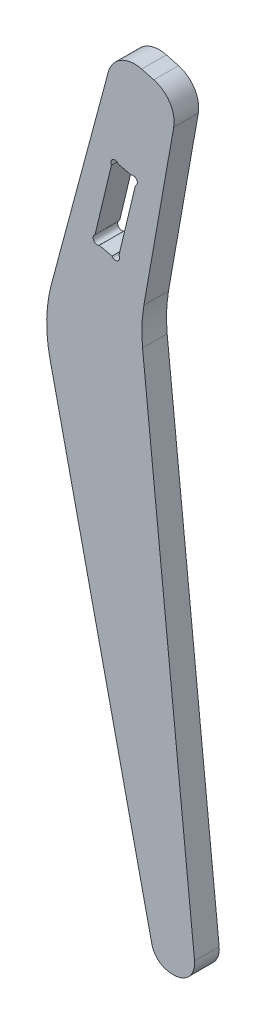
from build123d import *

# Parameters (mm, degrees)
BOSS_EXTRU_2_DEPTH      = 18
CONG_1_R                = 100
ESQUISSE3_R             = 3
ENL_V_MAT_EXTRU_1_DEPTH = 18
CONG_3_R                = 15


with BuildPart() as part:
    # Esquisse1 → Boss.-Extru.2 (new body)
    with BuildSketch(Plane.XY):
        with BuildLine():
            ThreePointArc((213.825932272, 109.907411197), (198.64955137, 107.909402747), (189.331034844, 95.765275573))
            Line((189.331034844, 95.765275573), (169.559058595, 21.975255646))
            Line((169.559058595, 21.975255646), (141.36967956, -83.228939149))
            Line((141.36967956, -83.228939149), (144.475206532, -97.127390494))
            Line((144.475206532, -97.127390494), (202.399217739, -356.360061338))
            Line((202.399217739, -356.360061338), (223.797917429, -452.12763609))
            Line((223.797917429, -452.12763609), (254.149379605, -452.12763609))
            Line((254.149379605, -452.12763609), (243.620871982, -349.951925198))
            Line((243.620871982, -349.951925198), (216.529275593, -87.036874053))
            Line((216.529275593, -87.036874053), (212.977033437, -52.563529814))
            Line((212.977033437, -52.563529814), (216.863831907, -30.520400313))
            Line((216.863831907, -30.520400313), (237.18849855, 84.746512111))
            ThreePointArc((237.18849855, 84.746512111), (234.360172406, 98.965467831), (222.668724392, 107.53799219))
            Line((222.668724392, 107.53799219), (213.825932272, 109.907411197))
        make_face()
        Polygon((178.681154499, -16.192918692), (192.655493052, 42.157041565), (194.718475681, 41.662974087), (196.78145831, 41.16890661), (210.160481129, 37.964739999), (196.186142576, -20.385220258), align=None, mode=Mode.SUBTRACT)
    extrude(amount=BOSS_EXTRU_2_DEPTH)

    # Cong_1
    cong_1_edges = [part.edges().sort_by_distance(p)[0] for p in [
        (212.977033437, -52.563529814, 9),
        (141.36967956, -83.228939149, 9),
    ]]
    fillet(cong_1_edges, radius=CONG_1_R)

    # Esquisse3 → Enl_v. mat.-Extru.1 (cut)
    with BuildSketch(Plane.XY.offset(18)):
        with Locations((194.224408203, 39.599991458)):
            Circle(ESQUISSE3_R)
        with Locations((194.617227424, -17.828170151)):
            Circle(ESQUISSE3_R)
        with Locations((207.603431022, 36.395824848)):
            Circle(ESQUISSE3_R)
        with Locations((181.238204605, -14.624003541)):
            Circle(ESQUISSE3_R)
    extrude(amount=-ENL_V_MAT_EXTRU_1_DEPTH, mode=Mode.SUBTRACT)

    # Cong_3
    cong_3_edges = [part.edges().sort_by_distance(p)[0] for p in [
        (254.149379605, -452.12763609, 9),
        (223.797917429, -452.12763609, 9),
    ]]
    fillet(cong_3_edges, radius=CONG_3_R)


solid = part.part
